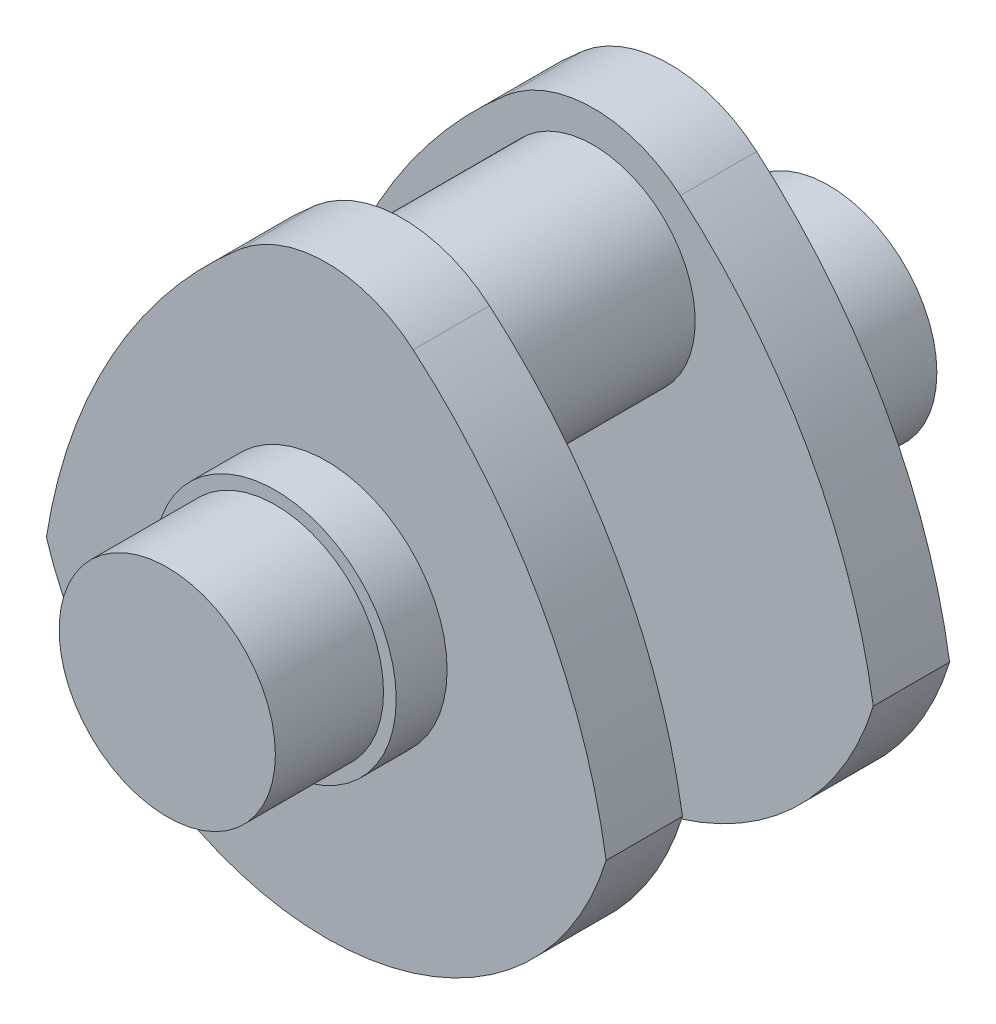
ISO-10303-21;
HEADER;
FILE_DESCRIPTION(('STEP AP214'),'2;1');
FILE_NAME('part.step','',(''),(''),'','','');
FILE_SCHEMA(('AUTOMOTIVE_DESIGN { 1 0 10303 214 1 1 1 1 }'));
ENDSEC;
DATA;
#1=APPLICATION_CONTEXT('core data for automotive mechanical design processes');
#2=APPLICATION_PROTOCOL_DEFINITION('international standard','automotive_design',2000,#1);
#3=PRODUCT_CONTEXT('',#1,'mechanical');
#4=PRODUCT('Part','Part','',(#3));
#5=PRODUCT_RELATED_PRODUCT_CATEGORY('part','',(#4));
#6=PRODUCT_DEFINITION_FORMATION('','',#4);
#7=PRODUCT_DEFINITION_CONTEXT('part definition',#1,'design');
#8=PRODUCT_DEFINITION('design','',#6,#7);
#9=PRODUCT_DEFINITION_SHAPE('','',#8);
#10=(LENGTH_UNIT() NAMED_UNIT(*) SI_UNIT(.MILLI.,.METRE.));
#11=(NAMED_UNIT(*) PLANE_ANGLE_UNIT() SI_UNIT($,.RADIAN.));
#12=(NAMED_UNIT(*) SI_UNIT($,.STERADIAN.) SOLID_ANGLE_UNIT());
#13=UNCERTAINTY_MEASURE_WITH_UNIT(LENGTH_MEASURE(1.E-05),#10,'distance_accuracy_value','');
#14=(GEOMETRIC_REPRESENTATION_CONTEXT(3) GLOBAL_UNCERTAINTY_ASSIGNED_CONTEXT((#13)) GLOBAL_UNIT_ASSIGNED_CONTEXT((#10,
#11,#12)) REPRESENTATION_CONTEXT('',''));
#15=CARTESIAN_POINT('',(0.,0.,0.));
#16=DIRECTION('',(0.,0.,1.));
#17=DIRECTION('',(1.,0.,0.));
#18=AXIS2_PLACEMENT_3D('',#15,#16,#17);
#19=CARTESIAN_POINT('',(0.,0.,25.));
#20=DIRECTION('',(0.,0.,-1.));
#21=DIRECTION('',(-1.,0.,0.));
#22=AXIS2_PLACEMENT_3D('',#19,#20,#21);
#23=CYLINDRICAL_SURFACE('',#22,17.);
#24=CARTESIAN_POINT('',(0.,0.,8.));
#25=DIRECTION('',(0.,0.,1.));
#26=DIRECTION('',(1.,0.,0.));
#27=AXIS2_PLACEMENT_3D('',#24,#25,#26);
#28=CIRCLE('',#27,17.);
#29=CARTESIAN_POINT('',(17.,0.,8.));
#30=VERTEX_POINT('',#29);
#31=EDGE_CURVE('E35',#30,#30,#28,.T.);
#32=ORIENTED_EDGE('',*,*,#31,.T.);
#33=EDGE_LOOP('',(#32));
#34=FACE_BOUND('',#33,.T.);
#35=CARTESIAN_POINT('',(0.,0.,25.));
#36=DIRECTION('',(0.,0.,1.));
#37=DIRECTION('',(1.,0.,0.));
#38=AXIS2_PLACEMENT_3D('',#35,#36,#37);
#39=CIRCLE('',#38,17.);
#40=CARTESIAN_POINT('',(17.,0.,25.));
#41=VERTEX_POINT('',#40);
#42=EDGE_CURVE('E11',#41,#41,#39,.T.);
#43=ORIENTED_EDGE('',*,*,#42,.F.);
#44=EDGE_LOOP('',(#43));
#45=FACE_BOUND('',#44,.T.);
#46=ADVANCED_FACE('F32',(#34,#45),#23,.T.);
#47=CARTESIAN_POINT('',(0.,0.,25.));
#48=DIRECTION('',(0.,0.,1.));
#49=DIRECTION('',(1.,0.,0.));
#50=AXIS2_PLACEMENT_3D('',#47,#48,#49);
#51=PLANE('',#50);
#52=ORIENTED_EDGE('',*,*,#42,.T.);
#53=EDGE_LOOP('',(#52));
#54=FACE_BOUND('',#53,.T.);
#55=ADVANCED_FACE('F222',(#54),#51,.T.);
#56=CARTESIAN_POINT('',(0.,0.,8.));
#57=DIRECTION('',(0.,0.,-1.));
#58=DIRECTION('',(-1.,0.,0.));
#59=AXIS2_PLACEMENT_3D('',#56,#57,#58);
#60=CYLINDRICAL_SURFACE('',#59,19.);
#61=CARTESIAN_POINT('',(0.,0.,8.));
#62=DIRECTION('',(0.,0.,1.));
#63=DIRECTION('',(1.,0.,0.));
#64=AXIS2_PLACEMENT_3D('',#61,#62,#63);
#65=CIRCLE('',#64,19.);
#66=CARTESIAN_POINT('',(19.,0.,8.));
#67=VERTEX_POINT('',#66);
#68=EDGE_CURVE('E189',#67,#67,#65,.T.);
#69=ORIENTED_EDGE('',*,*,#68,.F.);
#70=EDGE_LOOP('',(#69));
#71=FACE_BOUND('',#70,.T.);
#72=CARTESIAN_POINT('',(0.,0.,0.));
#73=DIRECTION('',(0.,0.,1.));
#74=DIRECTION('',(1.,0.,0.));
#75=AXIS2_PLACEMENT_3D('',#72,#73,#74);
#76=CIRCLE('',#75,19.);
#77=CARTESIAN_POINT('',(19.,0.,0.));
#78=VERTEX_POINT('',#77);
#79=EDGE_CURVE('E188',#78,#78,#76,.T.);
#80=ORIENTED_EDGE('',*,*,#79,.T.);
#81=EDGE_LOOP('',(#80));
#82=FACE_BOUND('',#81,.T.);
#83=ADVANCED_FACE('F195',(#71,#82),#60,.T.);
#84=CARTESIAN_POINT('',(0.,0.,8.));
#85=DIRECTION('',(0.,0.,1.));
#86=DIRECTION('',(1.,0.,0.));
#87=AXIS2_PLACEMENT_3D('',#84,#85,#86);
#88=PLANE('',#87);
#89=ORIENTED_EDGE('',*,*,#31,.F.);
#90=EDGE_LOOP('',(#89));
#91=FACE_BOUND('',#90,.T.);
#92=ORIENTED_EDGE('',*,*,#68,.T.);
#93=EDGE_LOOP('',(#92));
#94=FACE_BOUND('',#93,.T.);
#95=ADVANCED_FACE('F219',(#91,#94),#88,.T.);
#96=CARTESIAN_POINT('',(-44.9094542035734,-27.3845485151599,-12.));
#97=DIRECTION('',(0.,0.,1.));
#98=DIRECTION('',(1.,0.,0.));
#99=AXIS2_PLACEMENT_3D('',#96,#97,#98);
#100=CYLINDRICAL_SURFACE('',#99,90.);
#101=CARTESIAN_POINT('',(-44.9094542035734,-27.3845485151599,0.));
#102=DIRECTION('',(0.,0.,-1.));
#103=DIRECTION('',(-1.,0.,0.));
#104=AXIS2_PLACEMENT_3D('',#101,#102,#103);
#105=CIRCLE('',#104,90.);
#106=CARTESIAN_POINT('',(13.6680947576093,40.9431234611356,0.));
#107=VERTEX_POINT('',#106);
#108=CARTESIAN_POINT('',(44.,-13.4164078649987,0.));
#109=VERTEX_POINT('',#108);
#110=EDGE_CURVE('E167',#107,#109,#105,.T.);
#111=ORIENTED_EDGE('',*,*,#110,.T.);
#112=DIRECTION('',(0.,0.,1.));
#113=VECTOR('',#112,1.);
#114=CARTESIAN_POINT('',(44.,-13.4164078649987,-12.));
#115=LINE('',#114,#113);
#116=CARTESIAN_POINT('',(44.,-13.4164078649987,-12.));
#117=VERTEX_POINT('',#116);
#118=EDGE_CURVE('E186',#117,#109,#115,.T.);
#119=ORIENTED_EDGE('',*,*,#118,.F.);
#120=CARTESIAN_POINT('',(-44.9094542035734,-27.3845485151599,-12.));
#121=DIRECTION('',(0.,0.,-1.));
#122=DIRECTION('',(-1.,0.,0.));
#123=AXIS2_PLACEMENT_3D('',#120,#121,#122);
#124=CIRCLE('',#123,90.);
#125=CARTESIAN_POINT('',(13.6680947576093,40.9431234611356,-12.));
#126=VERTEX_POINT('',#125);
#127=EDGE_CURVE('E168',#126,#117,#124,.T.);
#128=ORIENTED_EDGE('',*,*,#127,.F.);
#129=DIRECTION('',(0.,0.,1.));
#130=VECTOR('',#129,1.);
#131=CARTESIAN_POINT('',(13.6680947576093,40.9431234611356,-12.));
#132=LINE('',#131,#130);
#133=EDGE_CURVE('E174',#126,#107,#132,.T.);
#134=ORIENTED_EDGE('',*,*,#133,.T.);
#135=EDGE_LOOP('',(#111,#119,#128,#134));
#136=FACE_BOUND('',#135,.T.);
#137=ADVANCED_FACE('F206',(#136),#100,.T.);
#138=CARTESIAN_POINT('',(0.,0.,-12.));
#139=DIRECTION('',(0.,0.,1.));
#140=DIRECTION('',(1.,0.,0.));
#141=AXIS2_PLACEMENT_3D('',#138,#139,#140);
#142=CYLINDRICAL_SURFACE('',#141,46.);
#143=CARTESIAN_POINT('',(0.,0.,0.));
#144=DIRECTION('',(0.,0.,-1.));
#145=DIRECTION('',(-1.,0.,0.));
#146=AXIS2_PLACEMENT_3D('',#143,#144,#145);
#147=CIRCLE('',#146,46.);
#148=CARTESIAN_POINT('',(-44.,-13.4164078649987,0.));
#149=VERTEX_POINT('',#148);
#150=EDGE_CURVE('E177',#109,#149,#147,.T.);
#151=ORIENTED_EDGE('',*,*,#150,.T.);
#152=DIRECTION('',(0.,0.,1.));
#153=VECTOR('',#152,1.);
#154=CARTESIAN_POINT('',(-44.,-13.4164078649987,-12.));
#155=LINE('',#154,#153);
#156=CARTESIAN_POINT('',(-44.,-13.4164078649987,-12.));
#157=VERTEX_POINT('',#156);
#158=EDGE_CURVE('E184',#157,#149,#155,.T.);
#159=ORIENTED_EDGE('',*,*,#158,.F.);
#160=CARTESIAN_POINT('',(0.,0.,-12.));
#161=DIRECTION('',(0.,0.,-1.));
#162=DIRECTION('',(-1.,0.,0.));
#163=AXIS2_PLACEMENT_3D('',#160,#161,#162);
#164=CIRCLE('',#163,46.);
#165=EDGE_CURVE('E80',#117,#157,#164,.T.);
#166=ORIENTED_EDGE('',*,*,#165,.F.);
#167=ORIENTED_EDGE('',*,*,#118,.T.);
#168=EDGE_LOOP('',(#151,#159,#166,#167));
#169=FACE_BOUND('',#168,.T.);
#170=ADVANCED_FACE('F211',(#169),#142,.T.);
#171=CARTESIAN_POINT('',(44.9094542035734,-27.3845485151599,-12.));
#172=DIRECTION('',(0.,0.,1.));
#173=DIRECTION('',(1.,0.,0.));
#174=AXIS2_PLACEMENT_3D('',#171,#172,#173);
#175=CYLINDRICAL_SURFACE('',#174,90.);
#176=CARTESIAN_POINT('',(44.9094542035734,-27.3845485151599,0.));
#177=DIRECTION('',(0.,0.,-1.));
#178=DIRECTION('',(1.,0.,0.));
#179=AXIS2_PLACEMENT_3D('',#176,#177,#178);
#180=CIRCLE('',#179,90.);
#181=CARTESIAN_POINT('',(-13.6680947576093,40.9431234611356,0.));
#182=VERTEX_POINT('',#181);
#183=EDGE_CURVE('E66',#149,#182,#180,.T.);
#184=ORIENTED_EDGE('',*,*,#183,.T.);
#185=DIRECTION('',(0.,0.,1.));
#186=VECTOR('',#185,1.);
#187=CARTESIAN_POINT('',(-13.6680947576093,40.9431234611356,-12.));
#188=LINE('',#187,#186);
#189=CARTESIAN_POINT('',(-13.6680947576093,40.9431234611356,-12.));
#190=VERTEX_POINT('',#189);
#191=EDGE_CURVE('E182',#190,#182,#188,.T.);
#192=ORIENTED_EDGE('',*,*,#191,.F.);
#193=CARTESIAN_POINT('',(44.9094542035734,-27.3845485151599,-12.));
#194=DIRECTION('',(0.,0.,-1.));
#195=DIRECTION('',(1.,0.,0.));
#196=AXIS2_PLACEMENT_3D('',#193,#194,#195);
#197=CIRCLE('',#196,90.);
#198=EDGE_CURVE('E171',#157,#190,#197,.T.);
#199=ORIENTED_EDGE('',*,*,#198,.F.);
#200=ORIENTED_EDGE('',*,*,#158,.T.);
#201=EDGE_LOOP('',(#184,#192,#199,#200));
#202=FACE_BOUND('',#201,.T.);
#203=ADVANCED_FACE('F210',(#202),#175,.T.);
#204=CARTESIAN_POINT('',(0.,25.,-12.));
#205=DIRECTION('',(0.,0.,1.));
#206=DIRECTION('',(1.,0.,0.));
#207=AXIS2_PLACEMENT_3D('',#204,#205,#206);
#208=CYLINDRICAL_SURFACE('',#207,21.);
#209=CARTESIAN_POINT('',(0.,25.,0.));
#210=DIRECTION('',(0.,0.,-1.));
#211=DIRECTION('',(-1.,0.,0.));
#212=AXIS2_PLACEMENT_3D('',#209,#210,#211);
#213=CIRCLE('',#212,21.);
#214=EDGE_CURVE('E72',#182,#107,#213,.T.);
#215=ORIENTED_EDGE('',*,*,#214,.T.);
#216=ORIENTED_EDGE('',*,*,#133,.F.);
#217=CARTESIAN_POINT('',(0.,25.,-12.));
#218=DIRECTION('',(0.,0.,-1.));
#219=DIRECTION('',(-1.,0.,0.));
#220=AXIS2_PLACEMENT_3D('',#217,#218,#219);
#221=CIRCLE('',#220,21.);
#222=EDGE_CURVE('E48',#190,#126,#221,.T.);
#223=ORIENTED_EDGE('',*,*,#222,.F.);
#224=ORIENTED_EDGE('',*,*,#191,.T.);
#225=EDGE_LOOP('',(#215,#216,#223,#224));
#226=FACE_BOUND('',#225,.T.);
#227=ADVANCED_FACE('F208',(#226),#208,.T.);
#228=CARTESIAN_POINT('',(-22.4547271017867,-13.69227425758,-12.));
#229=DIRECTION('',(0.,0.,-1.));
#230=DIRECTION('',(-1.,0.,0.));
#231=AXIS2_PLACEMENT_3D('',#228,#229,#230);
#232=PLANE('',#231);
#233=CARTESIAN_POINT('',(0.,25.,-12.));
#234=DIRECTION('',(0.,0.,-1.));
#235=DIRECTION('',(-1.,0.,0.));
#236=AXIS2_PLACEMENT_3D('',#233,#234,#235);
#237=CIRCLE('',#236,16.);
#238=CARTESIAN_POINT('',(-16.,25.,-12.));
#239=VERTEX_POINT('',#238);
#240=EDGE_CURVE('E162',#239,#239,#237,.T.);
#241=ORIENTED_EDGE('',*,*,#240,.F.);
#242=EDGE_LOOP('',(#241));
#243=FACE_BOUND('',#242,.T.);
#244=ORIENTED_EDGE('',*,*,#127,.T.);
#245=ORIENTED_EDGE('',*,*,#165,.T.);
#246=ORIENTED_EDGE('',*,*,#198,.T.);
#247=ORIENTED_EDGE('',*,*,#222,.T.);
#248=EDGE_LOOP('',(#244,#245,#246,#247));
#249=FACE_BOUND('',#248,.T.);
#250=ADVANCED_FACE('F201',(#243,#249),#232,.T.);
#251=CARTESIAN_POINT('',(-22.4547271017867,-13.69227425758,0.));
#252=DIRECTION('',(0.,0.,-1.));
#253=DIRECTION('',(-1.,0.,0.));
#254=AXIS2_PLACEMENT_3D('',#251,#252,#253);
#255=PLANE('',#254);
#256=ORIENTED_EDGE('',*,*,#79,.F.);
#257=EDGE_LOOP('',(#256));
#258=FACE_BOUND('',#257,.T.);
#259=ORIENTED_EDGE('',*,*,#110,.F.);
#260=ORIENTED_EDGE('',*,*,#214,.F.);
#261=ORIENTED_EDGE('',*,*,#183,.F.);
#262=ORIENTED_EDGE('',*,*,#150,.F.);
#263=EDGE_LOOP('',(#259,#260,#261,#262));
#264=FACE_BOUND('',#263,.T.);
#265=ADVANCED_FACE('F197',(#258,#264),#255,.F.);
#266=CARTESIAN_POINT('',(0.,25.,-27.));
#267=DIRECTION('',(0.,0.,1.));
#268=DIRECTION('',(1.,0.,0.));
#269=AXIS2_PLACEMENT_3D('',#266,#267,#268);
#270=CYLINDRICAL_SURFACE('',#269,16.);
#271=ORIENTED_EDGE('',*,*,#240,.T.);
#272=EDGE_LOOP('',(#271));
#273=FACE_BOUND('',#272,.T.);
#274=CARTESIAN_POINT('',(0.,25.,-42.));
#275=DIRECTION('',(0.,0.,-1.));
#276=DIRECTION('',(-1.,0.,0.));
#277=AXIS2_PLACEMENT_3D('',#274,#275,#276);
#278=CIRCLE('',#277,16.);
#279=CARTESIAN_POINT('',(-16.,25.,-42.));
#280=VERTEX_POINT('',#279);
#281=EDGE_CURVE('E138',#280,#280,#278,.T.);
#282=ORIENTED_EDGE('',*,*,#281,.F.);
#283=EDGE_LOOP('',(#282));
#284=FACE_BOUND('',#283,.T.);
#285=ADVANCED_FACE('F200',(#273,#284),#270,.T.);
#286=CARTESIAN_POINT('',(0.,0.,-79.));
#287=DIRECTION('',(0.,0.,1.));
#288=DIRECTION('',(-1.,0.,0.));
#289=AXIS2_PLACEMENT_3D('',#286,#287,#288);
#290=CYLINDRICAL_SURFACE('',#289,17.);
#291=CARTESIAN_POINT('',(0.,0.,-62.));
#292=DIRECTION('',(0.,0.,1.));
#293=DIRECTION('',(1.,0.,0.));
#294=AXIS2_PLACEMENT_3D('',#291,#292,#293);
#295=CIRCLE('',#294,17.);
#296=CARTESIAN_POINT('',(17.,0.,-62.));
#297=VERTEX_POINT('',#296);
#298=EDGE_CURVE('E156',#297,#297,#295,.T.);
#299=ORIENTED_EDGE('',*,*,#298,.F.);
#300=EDGE_LOOP('',(#299));
#301=FACE_BOUND('',#300,.T.);
#302=CARTESIAN_POINT('',(0.,0.,-79.));
#303=DIRECTION('',(0.,0.,1.));
#304=DIRECTION('',(1.,0.,0.));
#305=AXIS2_PLACEMENT_3D('',#302,#303,#304);
#306=CIRCLE('',#305,17.);
#307=CARTESIAN_POINT('',(17.,0.,-79.));
#308=VERTEX_POINT('',#307);
#309=EDGE_CURVE('E159',#308,#308,#306,.T.);
#310=ORIENTED_EDGE('',*,*,#309,.T.);
#311=EDGE_LOOP('',(#310));
#312=FACE_BOUND('',#311,.T.);
#313=ADVANCED_FACE('F268',(#301,#312),#290,.T.);
#314=CARTESIAN_POINT('',(0.,0.,-79.));
#315=DIRECTION('',(0.,0.,-1.));
#316=DIRECTION('',(1.,0.,0.));
#317=AXIS2_PLACEMENT_3D('',#314,#315,#316);
#318=PLANE('',#317);
#319=ORIENTED_EDGE('',*,*,#309,.F.);
#320=EDGE_LOOP('',(#319));
#321=FACE_BOUND('',#320,.T.);
#322=ADVANCED_FACE('F280',(#321),#318,.T.);
#323=CARTESIAN_POINT('',(0.,0.,-62.));
#324=DIRECTION('',(0.,0.,1.));
#325=DIRECTION('',(-1.,0.,0.));
#326=AXIS2_PLACEMENT_3D('',#323,#324,#325);
#327=CYLINDRICAL_SURFACE('',#326,19.);
#328=CARTESIAN_POINT('',(0.,0.,-62.));
#329=DIRECTION('',(0.,0.,1.));
#330=DIRECTION('',(1.,0.,0.));
#331=AXIS2_PLACEMENT_3D('',#328,#329,#330);
#332=CIRCLE('',#331,19.);
#333=CARTESIAN_POINT('',(19.,0.,-62.));
#334=VERTEX_POINT('',#333);
#335=EDGE_CURVE('E153',#334,#334,#332,.T.);
#336=ORIENTED_EDGE('',*,*,#335,.T.);
#337=EDGE_LOOP('',(#336));
#338=FACE_BOUND('',#337,.T.);
#339=CARTESIAN_POINT('',(0.,0.,-54.));
#340=DIRECTION('',(0.,0.,1.));
#341=DIRECTION('',(1.,0.,0.));
#342=AXIS2_PLACEMENT_3D('',#339,#340,#341);
#343=CIRCLE('',#342,19.);
#344=CARTESIAN_POINT('',(19.,0.,-54.));
#345=VERTEX_POINT('',#344);
#346=EDGE_CURVE('E127',#345,#345,#343,.T.);
#347=ORIENTED_EDGE('',*,*,#346,.F.);
#348=EDGE_LOOP('',(#347));
#349=FACE_BOUND('',#348,.T.);
#350=ADVANCED_FACE('F289',(#338,#349),#327,.T.);
#351=CARTESIAN_POINT('',(0.,0.,-62.));
#352=DIRECTION('',(0.,0.,-1.));
#353=DIRECTION('',(1.,0.,0.));
#354=AXIS2_PLACEMENT_3D('',#351,#352,#353);
#355=PLANE('',#354);
#356=ORIENTED_EDGE('',*,*,#298,.T.);
#357=EDGE_LOOP('',(#356));
#358=FACE_BOUND('',#357,.T.);
#359=ORIENTED_EDGE('',*,*,#335,.F.);
#360=EDGE_LOOP('',(#359));
#361=FACE_BOUND('',#360,.T.);
#362=ADVANCED_FACE('F298',(#358,#361),#355,.T.);
#363=CARTESIAN_POINT('',(-44.9094542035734,-27.3845485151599,-42.));
#364=DIRECTION('',(0.,0.,-1.));
#365=DIRECTION('',(1.,0.,0.));
#366=AXIS2_PLACEMENT_3D('',#363,#364,#365);
#367=CYLINDRICAL_SURFACE('',#366,90.);
#368=CARTESIAN_POINT('',(-44.9094542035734,-27.3845485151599,-54.));
#369=DIRECTION('',(0.,0.,-1.));
#370=DIRECTION('',(-1.,0.,0.));
#371=AXIS2_PLACEMENT_3D('',#368,#369,#370);
#372=CIRCLE('',#371,90.);
#373=CARTESIAN_POINT('',(13.6680947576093,40.9431234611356,-54.));
#374=VERTEX_POINT('',#373);
#375=CARTESIAN_POINT('',(44.,-13.4164078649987,-54.));
#376=VERTEX_POINT('',#375);
#377=EDGE_CURVE('E143',#374,#376,#372,.T.);
#378=ORIENTED_EDGE('',*,*,#377,.F.);
#379=DIRECTION('',(0.,0.,-1.));
#380=VECTOR('',#379,1.);
#381=CARTESIAN_POINT('',(13.6680947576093,40.9431234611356,-42.));
#382=LINE('',#381,#380);
#383=CARTESIAN_POINT('',(13.6680947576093,40.9431234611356,-42.));
#384=VERTEX_POINT('',#383);
#385=EDGE_CURVE('E132',#384,#374,#382,.T.);
#386=ORIENTED_EDGE('',*,*,#385,.F.);
#387=CARTESIAN_POINT('',(-44.9094542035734,-27.3845485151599,-42.));
#388=DIRECTION('',(0.,0.,-1.));
#389=DIRECTION('',(-1.,0.,0.));
#390=AXIS2_PLACEMENT_3D('',#387,#388,#389);
#391=CIRCLE('',#390,90.);
#392=CARTESIAN_POINT('',(44.,-13.4164078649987,-42.));
#393=VERTEX_POINT('',#392);
#394=EDGE_CURVE('E111',#384,#393,#391,.T.);
#395=ORIENTED_EDGE('',*,*,#394,.T.);
#396=DIRECTION('',(0.,0.,-1.));
#397=VECTOR('',#396,1.);
#398=CARTESIAN_POINT('',(44.,-13.4164078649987,-42.));
#399=LINE('',#398,#397);
#400=EDGE_CURVE('E120',#393,#376,#399,.T.);
#401=ORIENTED_EDGE('',*,*,#400,.T.);
#402=EDGE_LOOP('',(#378,#386,#395,#401));
#403=FACE_BOUND('',#402,.T.);
#404=ADVANCED_FACE('F130',(#403),#367,.T.);
#405=CARTESIAN_POINT('',(0.,0.,-42.));
#406=DIRECTION('',(0.,0.,-1.));
#407=DIRECTION('',(1.,0.,0.));
#408=AXIS2_PLACEMENT_3D('',#405,#406,#407);
#409=CYLINDRICAL_SURFACE('',#408,46.);
#410=CARTESIAN_POINT('',(0.,0.,-54.));
#411=DIRECTION('',(0.,0.,-1.));
#412=DIRECTION('',(-1.,0.,0.));
#413=AXIS2_PLACEMENT_3D('',#410,#411,#412);
#414=CIRCLE('',#413,46.);
#415=CARTESIAN_POINT('',(-44.,-13.4164078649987,-54.));
#416=VERTEX_POINT('',#415);
#417=EDGE_CURVE('E123',#376,#416,#414,.T.);
#418=ORIENTED_EDGE('',*,*,#417,.F.);
#419=ORIENTED_EDGE('',*,*,#400,.F.);
#420=CARTESIAN_POINT('',(0.,0.,-42.));
#421=DIRECTION('',(0.,0.,-1.));
#422=DIRECTION('',(-1.,0.,0.));
#423=AXIS2_PLACEMENT_3D('',#420,#421,#422);
#424=CIRCLE('',#423,46.);
#425=CARTESIAN_POINT('',(-44.,-13.4164078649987,-42.));
#426=VERTEX_POINT('',#425);
#427=EDGE_CURVE('E107',#393,#426,#424,.T.);
#428=ORIENTED_EDGE('',*,*,#427,.T.);
#429=DIRECTION('',(0.,0.,-1.));
#430=VECTOR('',#429,1.);
#431=CARTESIAN_POINT('',(-44.,-13.4164078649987,-42.));
#432=LINE('',#431,#430);
#433=EDGE_CURVE('E128',#426,#416,#432,.T.);
#434=ORIENTED_EDGE('',*,*,#433,.T.);
#435=EDGE_LOOP('',(#418,#419,#428,#434));
#436=FACE_BOUND('',#435,.T.);
#437=ADVANCED_FACE('F121',(#436),#409,.T.);
#438=CARTESIAN_POINT('',(44.9094542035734,-27.3845485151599,-42.));
#439=DIRECTION('',(0.,0.,-1.));
#440=DIRECTION('',(1.,0.,0.));
#441=AXIS2_PLACEMENT_3D('',#438,#439,#440);
#442=CYLINDRICAL_SURFACE('',#441,90.);
#443=CARTESIAN_POINT('',(44.9094542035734,-27.3845485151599,-54.));
#444=DIRECTION('',(0.,0.,-1.));
#445=DIRECTION('',(1.,0.,0.));
#446=AXIS2_PLACEMENT_3D('',#443,#444,#445);
#447=CIRCLE('',#446,90.);
#448=CARTESIAN_POINT('',(-13.6680947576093,40.9431234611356,-54.));
#449=VERTEX_POINT('',#448);
#450=EDGE_CURVE('E135',#416,#449,#447,.T.);
#451=ORIENTED_EDGE('',*,*,#450,.F.);
#452=ORIENTED_EDGE('',*,*,#433,.F.);
#453=CARTESIAN_POINT('',(44.9094542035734,-27.3845485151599,-42.));
#454=DIRECTION('',(0.,0.,-1.));
#455=DIRECTION('',(1.,0.,0.));
#456=AXIS2_PLACEMENT_3D('',#453,#454,#455);
#457=CIRCLE('',#456,90.);
#458=CARTESIAN_POINT('',(-13.6680947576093,40.9431234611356,-42.));
#459=VERTEX_POINT('',#458);
#460=EDGE_CURVE('E114',#426,#459,#457,.T.);
#461=ORIENTED_EDGE('',*,*,#460,.T.);
#462=DIRECTION('',(0.,0.,-1.));
#463=VECTOR('',#462,1.);
#464=CARTESIAN_POINT('',(-13.6680947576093,40.9431234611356,-42.));
#465=LINE('',#464,#463);
#466=EDGE_CURVE('E149',#459,#449,#465,.T.);
#467=ORIENTED_EDGE('',*,*,#466,.T.);
#468=EDGE_LOOP('',(#451,#452,#461,#467));
#469=FACE_BOUND('',#468,.T.);
#470=ADVANCED_FACE('F322',(#469),#442,.T.);
#471=CARTESIAN_POINT('',(0.,25.,-42.));
#472=DIRECTION('',(0.,0.,-1.));
#473=DIRECTION('',(1.,0.,0.));
#474=AXIS2_PLACEMENT_3D('',#471,#472,#473);
#475=CYLINDRICAL_SURFACE('',#474,21.);
#476=CARTESIAN_POINT('',(0.,25.,-54.));
#477=DIRECTION('',(0.,0.,-1.));
#478=DIRECTION('',(-1.,0.,0.));
#479=AXIS2_PLACEMENT_3D('',#476,#477,#478);
#480=CIRCLE('',#479,21.);
#481=EDGE_CURVE('E133',#449,#374,#480,.T.);
#482=ORIENTED_EDGE('',*,*,#481,.F.);
#483=ORIENTED_EDGE('',*,*,#466,.F.);
#484=CARTESIAN_POINT('',(0.,25.,-42.));
#485=DIRECTION('',(0.,0.,-1.));
#486=DIRECTION('',(-1.,0.,0.));
#487=AXIS2_PLACEMENT_3D('',#484,#485,#486);
#488=CIRCLE('',#487,21.);
#489=EDGE_CURVE('E141',#459,#384,#488,.T.);
#490=ORIENTED_EDGE('',*,*,#489,.T.);
#491=ORIENTED_EDGE('',*,*,#385,.T.);
#492=EDGE_LOOP('',(#482,#483,#490,#491));
#493=FACE_BOUND('',#492,.T.);
#494=ADVANCED_FACE('F330',(#493),#475,.T.);
#495=CARTESIAN_POINT('',(-22.4547271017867,-13.69227425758,-42.));
#496=DIRECTION('',(0.,0.,1.));
#497=DIRECTION('',(-1.,0.,0.));
#498=AXIS2_PLACEMENT_3D('',#495,#496,#497);
#499=PLANE('',#498);
#500=ORIENTED_EDGE('',*,*,#281,.T.);
#501=EDGE_LOOP('',(#500));
#502=FACE_BOUND('',#501,.T.);
#503=ORIENTED_EDGE('',*,*,#394,.F.);
#504=ORIENTED_EDGE('',*,*,#489,.F.);
#505=ORIENTED_EDGE('',*,*,#460,.F.);
#506=ORIENTED_EDGE('',*,*,#427,.F.);
#507=EDGE_LOOP('',(#503,#504,#505,#506));
#508=FACE_BOUND('',#507,.T.);
#509=ADVANCED_FACE('F109',(#502,#508),#499,.T.);
#510=CARTESIAN_POINT('',(-22.4547271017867,-13.69227425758,-54.));
#511=DIRECTION('',(0.,0.,1.));
#512=DIRECTION('',(-1.,0.,0.));
#513=AXIS2_PLACEMENT_3D('',#510,#511,#512);
#514=PLANE('',#513);
#515=ORIENTED_EDGE('',*,*,#346,.T.);
#516=EDGE_LOOP('',(#515));
#517=FACE_BOUND('',#516,.T.);
#518=ORIENTED_EDGE('',*,*,#377,.T.);
#519=ORIENTED_EDGE('',*,*,#417,.T.);
#520=ORIENTED_EDGE('',*,*,#450,.T.);
#521=ORIENTED_EDGE('',*,*,#481,.T.);
#522=EDGE_LOOP('',(#518,#519,#520,#521));
#523=FACE_BOUND('',#522,.T.);
#524=ADVANCED_FACE('F347',(#517,#523),#514,.F.);
#525=CLOSED_SHELL('',(#46,#55,#83,#95,#137,#170,#203,#227,#250,#265,#285,#313,#322,#350,#362,
#404,#437,#470,#494,#509,#524));
#526=MANIFOLD_SOLID_BREP('B2',#525);
#527=ADVANCED_BREP_SHAPE_REPRESENTATION('',(#18,#526),#14);
#528=SHAPE_DEFINITION_REPRESENTATION(#9,#527);
ENDSEC;
END-ISO-10303-21;
